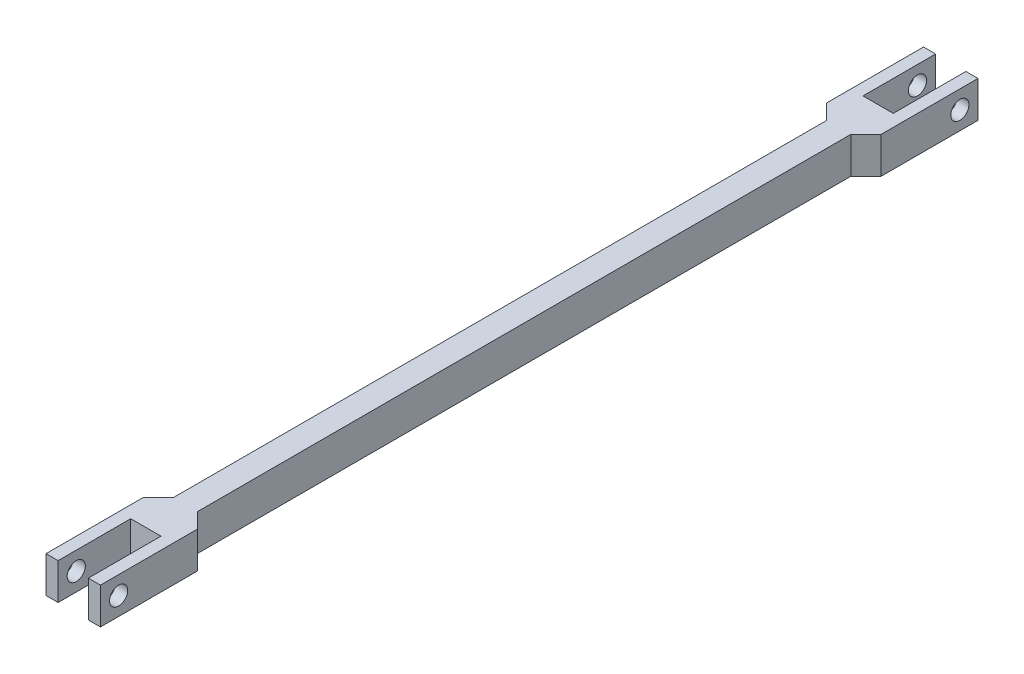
ISO-10303-21;
HEADER;
FILE_DESCRIPTION(('STEP AP214'),'2;1');
FILE_NAME('part.step','',(''),(''),'','','');
FILE_SCHEMA(('AUTOMOTIVE_DESIGN { 1 0 10303 214 1 1 1 1 }'));
ENDSEC;
DATA;
#1=APPLICATION_CONTEXT('core data for automotive mechanical design processes');
#2=APPLICATION_PROTOCOL_DEFINITION('international standard','automotive_design',2000,#1);
#3=PRODUCT_CONTEXT('',#1,'mechanical');
#4=PRODUCT('Part','Part','',(#3));
#5=PRODUCT_RELATED_PRODUCT_CATEGORY('part','',(#4));
#6=PRODUCT_DEFINITION_FORMATION('','',#4);
#7=PRODUCT_DEFINITION_CONTEXT('part definition',#1,'design');
#8=PRODUCT_DEFINITION('design','',#6,#7);
#9=PRODUCT_DEFINITION_SHAPE('','',#8);
#10=(LENGTH_UNIT() NAMED_UNIT(*) SI_UNIT(.MILLI.,.METRE.));
#11=(NAMED_UNIT(*) PLANE_ANGLE_UNIT() SI_UNIT($,.RADIAN.));
#12=(NAMED_UNIT(*) SI_UNIT($,.STERADIAN.) SOLID_ANGLE_UNIT());
#13=UNCERTAINTY_MEASURE_WITH_UNIT(LENGTH_MEASURE(1.E-05),#10,'distance_accuracy_value','');
#14=(GEOMETRIC_REPRESENTATION_CONTEXT(3) GLOBAL_UNCERTAINTY_ASSIGNED_CONTEXT((#13)) GLOBAL_UNIT_ASSIGNED_CONTEXT((#10,
#11,#12)) REPRESENTATION_CONTEXT('',''));
#15=CARTESIAN_POINT('',(0.,0.,0.));
#16=DIRECTION('',(0.,0.,1.));
#17=DIRECTION('',(1.,0.,0.));
#18=AXIS2_PLACEMENT_3D('',#15,#16,#17);
#19=CARTESIAN_POINT('',(-7.,6.,-145.));
#20=DIRECTION('',(0.,0.,1.));
#21=DIRECTION('',(1.,0.,0.));
#22=AXIS2_PLACEMENT_3D('',#19,#20,#21);
#23=PLANE('',#22);
#24=DIRECTION('',(-1.,0.,0.));
#25=VECTOR('',#24,1.);
#26=CARTESIAN_POINT('',(-7.,0.,-145.));
#27=LINE('',#26,#25);
#28=CARTESIAN_POINT('',(-7.,0.,-145.));
#29=VERTEX_POINT('',#28);
#30=CARTESIAN_POINT('',(-9.,0.,-145.));
#31=VERTEX_POINT('',#30);
#32=EDGE_CURVE('E202',#29,#31,#27,.T.);
#33=ORIENTED_EDGE('',*,*,#32,.T.);
#34=DIRECTION('',(0.,-1.,0.));
#35=VECTOR('',#34,1.);
#36=CARTESIAN_POINT('',(-9.,6.,-145.));
#37=LINE('',#36,#35);
#38=CARTESIAN_POINT('',(-9.,6.,-145.));
#39=VERTEX_POINT('',#38);
#40=EDGE_CURVE('E11',#39,#31,#37,.T.);
#41=ORIENTED_EDGE('',*,*,#40,.F.);
#42=DIRECTION('',(-1.,0.,0.));
#43=VECTOR('',#42,1.);
#44=CARTESIAN_POINT('',(-7.,6.,-145.));
#45=LINE('',#44,#43);
#46=CARTESIAN_POINT('',(-7.,6.,-145.));
#47=VERTEX_POINT('',#46);
#48=EDGE_CURVE('E241',#47,#39,#45,.T.);
#49=ORIENTED_EDGE('',*,*,#48,.F.);
#50=DIRECTION('',(0.,-1.,0.));
#51=VECTOR('',#50,1.);
#52=CARTESIAN_POINT('',(-7.,6.,-145.));
#53=LINE('',#52,#51);
#54=EDGE_CURVE('E198',#47,#29,#53,.T.);
#55=ORIENTED_EDGE('',*,*,#54,.T.);
#56=EDGE_LOOP('',(#33,#41,#49,#55));
#57=FACE_BOUND('',#56,.T.);
#58=ADVANCED_FACE('F33',(#57),#23,.F.);
#59=CARTESIAN_POINT('',(-9.,6.,-145.));
#60=DIRECTION('',(1.,0.,0.));
#61=DIRECTION('',(0.,0.,-1.));
#62=AXIS2_PLACEMENT_3D('',#59,#60,#61);
#63=PLANE('',#62);
#64=CARTESIAN_POINT('',(-9.,3.,-142.000000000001));
#65=DIRECTION('',(-1.,0.,0.));
#66=DIRECTION('',(0.,0.,1.));
#67=AXIS2_PLACEMENT_3D('',#64,#65,#66);
#68=CIRCLE('',#67,1.5);
#69=CARTESIAN_POINT('',(-9.,3.,-140.500000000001));
#70=VERTEX_POINT('',#69);
#71=EDGE_CURVE('E469',#70,#70,#68,.T.);
#72=ORIENTED_EDGE('',*,*,#71,.F.);
#73=EDGE_LOOP('',(#72));
#74=FACE_BOUND('',#73,.T.);
#75=DIRECTION('',(0.,0.,1.));
#76=VECTOR('',#75,1.);
#77=CARTESIAN_POINT('',(-9.,0.,-145.));
#78=LINE('',#77,#76);
#79=CARTESIAN_POINT('',(-9.,0.,-129.));
#80=VERTEX_POINT('',#79);
#81=EDGE_CURVE('E205',#31,#80,#78,.T.);
#82=ORIENTED_EDGE('',*,*,#81,.T.);
#83=DIRECTION('',(0.,-1.,0.));
#84=VECTOR('',#83,1.);
#85=CARTESIAN_POINT('',(-9.,6.,-129.));
#86=LINE('',#85,#84);
#87=CARTESIAN_POINT('',(-9.,6.,-129.));
#88=VERTEX_POINT('',#87);
#89=EDGE_CURVE('E42',#88,#80,#86,.T.);
#90=ORIENTED_EDGE('',*,*,#89,.F.);
#91=DIRECTION('',(0.,0.,1.));
#92=VECTOR('',#91,1.);
#93=CARTESIAN_POINT('',(-9.,6.,-145.));
#94=LINE('',#93,#92);
#95=EDGE_CURVE('E129',#39,#88,#94,.T.);
#96=ORIENTED_EDGE('',*,*,#95,.F.);
#97=ORIENTED_EDGE('',*,*,#40,.T.);
#98=EDGE_LOOP('',(#82,#90,#96,#97));
#99=FACE_BOUND('',#98,.T.);
#100=ADVANCED_FACE('F362',(#74,#99),#63,.F.);
#101=CARTESIAN_POINT('',(-9.,6.,-129.));
#102=DIRECTION('',(0.707106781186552,0.,-0.707106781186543));
#103=DIRECTION('',(-0.707106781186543,0.,-0.707106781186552));
#104=AXIS2_PLACEMENT_3D('',#101,#102,#103);
#105=PLANE('',#104);
#106=DIRECTION('',(0.707106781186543,0.,0.707106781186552));
#107=VECTOR('',#106,1.);
#108=CARTESIAN_POINT('',(-9.,0.,-129.));
#109=LINE('',#108,#107);
#110=CARTESIAN_POINT('',(-6.5,0.,-126.5));
#111=VERTEX_POINT('',#110);
#112=EDGE_CURVE('E208',#80,#111,#109,.T.);
#113=ORIENTED_EDGE('',*,*,#112,.T.);
#114=DIRECTION('',(0.,-1.,0.));
#115=VECTOR('',#114,1.);
#116=CARTESIAN_POINT('',(-6.5,6.,-126.5));
#117=LINE('',#116,#115);
#118=CARTESIAN_POINT('',(-6.5,6.,-126.5));
#119=VERTEX_POINT('',#118);
#120=EDGE_CURVE('E284',#119,#111,#117,.T.);
#121=ORIENTED_EDGE('',*,*,#120,.F.);
#122=DIRECTION('',(0.707106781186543,0.,0.707106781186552));
#123=VECTOR('',#122,1.);
#124=CARTESIAN_POINT('',(-9.,6.,-129.));
#125=LINE('',#124,#123);
#126=EDGE_CURVE('E293',#88,#119,#125,.T.);
#127=ORIENTED_EDGE('',*,*,#126,.F.);
#128=ORIENTED_EDGE('',*,*,#89,.T.);
#129=EDGE_LOOP('',(#113,#121,#127,#128));
#130=FACE_BOUND('',#129,.T.);
#131=ADVANCED_FACE('F291',(#130),#105,.F.);
#132=CARTESIAN_POINT('',(-6.5,6.,-126.5));
#133=DIRECTION('',(1.,0.,0.));
#134=DIRECTION('',(0.,0.,-1.));
#135=AXIS2_PLACEMENT_3D('',#132,#133,#134);
#136=PLANE('',#135);
#137=DIRECTION('',(0.,0.,1.));
#138=VECTOR('',#137,1.);
#139=CARTESIAN_POINT('',(-6.5,0.,-126.5));
#140=LINE('',#139,#138);
#141=CARTESIAN_POINT('',(-6.49999999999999,0.,-18.5));
#142=VERTEX_POINT('',#141);
#143=EDGE_CURVE('E210',#111,#142,#140,.T.);
#144=ORIENTED_EDGE('',*,*,#143,.T.);
#145=DIRECTION('',(0.,-1.,0.));
#146=VECTOR('',#145,1.);
#147=CARTESIAN_POINT('',(-6.49999999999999,6.,-18.5));
#148=LINE('',#147,#146);
#149=CARTESIAN_POINT('',(-6.49999999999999,6.,-18.5));
#150=VERTEX_POINT('',#149);
#151=EDGE_CURVE('E281',#150,#142,#148,.T.);
#152=ORIENTED_EDGE('',*,*,#151,.F.);
#153=DIRECTION('',(0.,0.,1.));
#154=VECTOR('',#153,1.);
#155=CARTESIAN_POINT('',(-6.5,6.,-126.5));
#156=LINE('',#155,#154);
#157=EDGE_CURVE('E311',#119,#150,#156,.T.);
#158=ORIENTED_EDGE('',*,*,#157,.F.);
#159=ORIENTED_EDGE('',*,*,#120,.T.);
#160=EDGE_LOOP('',(#144,#152,#158,#159));
#161=FACE_BOUND('',#160,.T.);
#162=ADVANCED_FACE('F302',(#161),#136,.F.);
#163=CARTESIAN_POINT('',(-6.49999999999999,6.,-18.5));
#164=DIRECTION('',(0.707106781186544,0.,0.707106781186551));
#165=DIRECTION('',(0.707106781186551,0.,-0.707106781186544));
#166=AXIS2_PLACEMENT_3D('',#163,#164,#165);
#167=PLANE('',#166);
#168=DIRECTION('',(-0.707106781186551,0.,0.707106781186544));
#169=VECTOR('',#168,1.);
#170=CARTESIAN_POINT('',(-6.49999999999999,0.,-18.5));
#171=LINE('',#170,#169);
#172=CARTESIAN_POINT('',(-9.00000000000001,0.,-16.));
#173=VERTEX_POINT('',#172);
#174=EDGE_CURVE('E212',#142,#173,#171,.T.);
#175=ORIENTED_EDGE('',*,*,#174,.T.);
#176=DIRECTION('',(0.,-1.,0.));
#177=VECTOR('',#176,1.);
#178=CARTESIAN_POINT('',(-9.00000000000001,6.,-16.));
#179=LINE('',#178,#177);
#180=CARTESIAN_POINT('',(-9.00000000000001,6.,-16.));
#181=VERTEX_POINT('',#180);
#182=EDGE_CURVE('E278',#181,#173,#179,.T.);
#183=ORIENTED_EDGE('',*,*,#182,.F.);
#184=DIRECTION('',(-0.707106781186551,0.,0.707106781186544));
#185=VECTOR('',#184,1.);
#186=CARTESIAN_POINT('',(-6.49999999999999,6.,-18.5));
#187=LINE('',#186,#185);
#188=EDGE_CURVE('E308',#150,#181,#187,.T.);
#189=ORIENTED_EDGE('',*,*,#188,.F.);
#190=ORIENTED_EDGE('',*,*,#151,.T.);
#191=EDGE_LOOP('',(#175,#183,#189,#190));
#192=FACE_BOUND('',#191,.T.);
#193=ADVANCED_FACE('F306',(#192),#167,.F.);
#194=CARTESIAN_POINT('',(-9.00000000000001,6.,-16.));
#195=DIRECTION('',(1.,0.,0.));
#196=DIRECTION('',(0.,0.,-1.));
#197=AXIS2_PLACEMENT_3D('',#194,#195,#196);
#198=PLANE('',#197);
#199=CARTESIAN_POINT('',(-8.99999999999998,3.,-3.));
#200=DIRECTION('',(-1.,0.,0.));
#201=DIRECTION('',(0.,0.,1.));
#202=AXIS2_PLACEMENT_3D('',#199,#200,#201);
#203=CIRCLE('',#202,1.5);
#204=CARTESIAN_POINT('',(-8.99999999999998,3.,-1.5));
#205=VERTEX_POINT('',#204);
#206=EDGE_CURVE('E436',#205,#205,#203,.T.);
#207=ORIENTED_EDGE('',*,*,#206,.F.);
#208=EDGE_LOOP('',(#207));
#209=FACE_BOUND('',#208,.T.);
#210=DIRECTION('',(0.,0.,1.));
#211=VECTOR('',#210,1.);
#212=CARTESIAN_POINT('',(-9.00000000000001,0.,-16.));
#213=LINE('',#212,#211);
#214=CARTESIAN_POINT('',(-9.,0.,0.));
#215=VERTEX_POINT('',#214);
#216=EDGE_CURVE('E214',#173,#215,#213,.T.);
#217=ORIENTED_EDGE('',*,*,#216,.T.);
#218=DIRECTION('',(0.,-1.,0.));
#219=VECTOR('',#218,1.);
#220=CARTESIAN_POINT('',(-9.,6.,0.));
#221=LINE('',#220,#219);
#222=CARTESIAN_POINT('',(-9.,6.,0.));
#223=VERTEX_POINT('',#222);
#224=EDGE_CURVE('E275',#223,#215,#221,.T.);
#225=ORIENTED_EDGE('',*,*,#224,.F.);
#226=DIRECTION('',(0.,0.,1.));
#227=VECTOR('',#226,1.);
#228=CARTESIAN_POINT('',(-9.00000000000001,6.,-16.));
#229=LINE('',#228,#227);
#230=EDGE_CURVE('E310',#181,#223,#229,.T.);
#231=ORIENTED_EDGE('',*,*,#230,.F.);
#232=ORIENTED_EDGE('',*,*,#182,.T.);
#233=EDGE_LOOP('',(#217,#225,#231,#232));
#234=FACE_BOUND('',#233,.T.);
#235=ADVANCED_FACE('F377',(#209,#234),#198,.F.);
#236=CARTESIAN_POINT('',(-9.,6.,0.));
#237=DIRECTION('',(0.,0.,-1.));
#238=DIRECTION('',(-1.,0.,0.));
#239=AXIS2_PLACEMENT_3D('',#236,#237,#238);
#240=PLANE('',#239);
#241=DIRECTION('',(1.,0.,0.));
#242=VECTOR('',#241,1.);
#243=CARTESIAN_POINT('',(-9.,0.,0.));
#244=LINE('',#243,#242);
#245=CARTESIAN_POINT('',(-7.,0.,0.));
#246=VERTEX_POINT('',#245);
#247=EDGE_CURVE('E216',#215,#246,#244,.T.);
#248=ORIENTED_EDGE('',*,*,#247,.T.);
#249=DIRECTION('',(0.,-1.,0.));
#250=VECTOR('',#249,1.);
#251=CARTESIAN_POINT('',(-7.,6.,0.));
#252=LINE('',#251,#250);
#253=CARTESIAN_POINT('',(-7.,6.,0.));
#254=VERTEX_POINT('',#253);
#255=EDGE_CURVE('E272',#254,#246,#252,.T.);
#256=ORIENTED_EDGE('',*,*,#255,.F.);
#257=DIRECTION('',(1.,0.,0.));
#258=VECTOR('',#257,1.);
#259=CARTESIAN_POINT('',(-9.,6.,0.));
#260=LINE('',#259,#258);
#261=EDGE_CURVE('E313',#223,#254,#260,.T.);
#262=ORIENTED_EDGE('',*,*,#261,.F.);
#263=ORIENTED_EDGE('',*,*,#224,.T.);
#264=EDGE_LOOP('',(#248,#256,#262,#263));
#265=FACE_BOUND('',#264,.T.);
#266=ADVANCED_FACE('F380',(#265),#240,.F.);
#267=CARTESIAN_POINT('',(-7.,6.,0.));
#268=DIRECTION('',(-1.,0.,0.));
#269=DIRECTION('',(0.,0.,1.));
#270=AXIS2_PLACEMENT_3D('',#267,#268,#269);
#271=PLANE('',#270);
#272=CARTESIAN_POINT('',(-7.,3.,-3.));
#273=DIRECTION('',(-1.,0.,0.));
#274=DIRECTION('',(0.,0.,1.));
#275=AXIS2_PLACEMENT_3D('',#272,#273,#274);
#276=CIRCLE('',#275,1.5);
#277=CARTESIAN_POINT('',(-7.,3.,-1.5));
#278=VERTEX_POINT('',#277);
#279=EDGE_CURVE('E206',#278,#278,#276,.T.);
#280=ORIENTED_EDGE('',*,*,#279,.T.);
#281=EDGE_LOOP('',(#280));
#282=FACE_BOUND('',#281,.T.);
#283=DIRECTION('',(0.,0.,-1.));
#284=VECTOR('',#283,1.);
#285=CARTESIAN_POINT('',(-7.,0.,0.));
#286=LINE('',#285,#284);
#287=CARTESIAN_POINT('',(-7.,0.,-12.));
#288=VERTEX_POINT('',#287);
#289=EDGE_CURVE('E218',#246,#288,#286,.T.);
#290=ORIENTED_EDGE('',*,*,#289,.T.);
#291=DIRECTION('',(0.,-1.,0.));
#292=VECTOR('',#291,1.);
#293=CARTESIAN_POINT('',(-7.,6.,-12.));
#294=LINE('',#293,#292);
#295=CARTESIAN_POINT('',(-7.,6.,-12.));
#296=VERTEX_POINT('',#295);
#297=EDGE_CURVE('E269',#296,#288,#294,.T.);
#298=ORIENTED_EDGE('',*,*,#297,.F.);
#299=DIRECTION('',(0.,0.,-1.));
#300=VECTOR('',#299,1.);
#301=CARTESIAN_POINT('',(-7.,6.,0.));
#302=LINE('',#301,#300);
#303=EDGE_CURVE('E319',#254,#296,#302,.T.);
#304=ORIENTED_EDGE('',*,*,#303,.F.);
#305=ORIENTED_EDGE('',*,*,#255,.T.);
#306=EDGE_LOOP('',(#290,#298,#304,#305));
#307=FACE_BOUND('',#306,.T.);
#308=ADVANCED_FACE('F384',(#282,#307),#271,.F.);
#309=CARTESIAN_POINT('',(-7.,6.,-12.));
#310=DIRECTION('',(0.,0.,-1.));
#311=DIRECTION('',(-1.,0.,0.));
#312=AXIS2_PLACEMENT_3D('',#309,#310,#311);
#313=PLANE('',#312);
#314=DIRECTION('',(1.,0.,0.));
#315=VECTOR('',#314,1.);
#316=CARTESIAN_POINT('',(-7.,0.,-12.));
#317=LINE('',#316,#315);
#318=CARTESIAN_POINT('',(-2.,0.,-12.));
#319=VERTEX_POINT('',#318);
#320=EDGE_CURVE('E220',#288,#319,#317,.T.);
#321=ORIENTED_EDGE('',*,*,#320,.T.);
#322=DIRECTION('',(0.,-1.,0.));
#323=VECTOR('',#322,1.);
#324=CARTESIAN_POINT('',(-2.,6.,-12.));
#325=LINE('',#324,#323);
#326=CARTESIAN_POINT('',(-2.,6.,-12.));
#327=VERTEX_POINT('',#326);
#328=EDGE_CURVE('E266',#327,#319,#325,.T.);
#329=ORIENTED_EDGE('',*,*,#328,.F.);
#330=DIRECTION('',(1.,0.,0.));
#331=VECTOR('',#330,1.);
#332=CARTESIAN_POINT('',(-7.,6.,-12.));
#333=LINE('',#332,#331);
#334=EDGE_CURVE('E321',#296,#327,#333,.T.);
#335=ORIENTED_EDGE('',*,*,#334,.F.);
#336=ORIENTED_EDGE('',*,*,#297,.T.);
#337=EDGE_LOOP('',(#321,#329,#335,#336));
#338=FACE_BOUND('',#337,.T.);
#339=ADVANCED_FACE('F388',(#338),#313,.F.);
#340=CARTESIAN_POINT('',(-2.,6.,-12.));
#341=DIRECTION('',(1.,0.,0.));
#342=DIRECTION('',(0.,0.,-1.));
#343=AXIS2_PLACEMENT_3D('',#340,#341,#342);
#344=PLANE('',#343);
#345=CARTESIAN_POINT('',(-2.,3.,-3.));
#346=DIRECTION('',(1.,0.,0.));
#347=DIRECTION('',(0.,0.,-1.));
#348=AXIS2_PLACEMENT_3D('',#345,#346,#347);
#349=CIRCLE('',#348,1.5);
#350=CARTESIAN_POINT('',(-2.,3.,-4.5));
#351=VERTEX_POINT('',#350);
#352=EDGE_CURVE('E430',#351,#351,#349,.T.);
#353=ORIENTED_EDGE('',*,*,#352,.T.);
#354=EDGE_LOOP('',(#353));
#355=FACE_BOUND('',#354,.T.);
#356=DIRECTION('',(0.,0.,1.));
#357=VECTOR('',#356,1.);
#358=CARTESIAN_POINT('',(-2.,0.,-12.));
#359=LINE('',#358,#357);
#360=CARTESIAN_POINT('',(-2.,0.,0.));
#361=VERTEX_POINT('',#360);
#362=EDGE_CURVE('E222',#319,#361,#359,.T.);
#363=ORIENTED_EDGE('',*,*,#362,.T.);
#364=DIRECTION('',(0.,-1.,0.));
#365=VECTOR('',#364,1.);
#366=CARTESIAN_POINT('',(-2.,6.,0.));
#367=LINE('',#366,#365);
#368=CARTESIAN_POINT('',(-2.,6.,0.));
#369=VERTEX_POINT('',#368);
#370=EDGE_CURVE('E263',#369,#361,#367,.T.);
#371=ORIENTED_EDGE('',*,*,#370,.F.);
#372=DIRECTION('',(0.,0.,1.));
#373=VECTOR('',#372,1.);
#374=CARTESIAN_POINT('',(-2.,6.,-12.));
#375=LINE('',#374,#373);
#376=EDGE_CURVE('E323',#327,#369,#375,.T.);
#377=ORIENTED_EDGE('',*,*,#376,.F.);
#378=ORIENTED_EDGE('',*,*,#328,.T.);
#379=EDGE_LOOP('',(#363,#371,#377,#378));
#380=FACE_BOUND('',#379,.T.);
#381=ADVANCED_FACE('F392',(#355,#380),#344,.F.);
#382=CARTESIAN_POINT('',(-2.,6.,0.));
#383=DIRECTION('',(0.,0.,-1.));
#384=DIRECTION('',(-1.,0.,0.));
#385=AXIS2_PLACEMENT_3D('',#382,#383,#384);
#386=PLANE('',#385);
#387=DIRECTION('',(1.,0.,0.));
#388=VECTOR('',#387,1.);
#389=CARTESIAN_POINT('',(-2.,0.,0.));
#390=LINE('',#389,#388);
#391=CARTESIAN_POINT('',(0.,0.,0.));
#392=VERTEX_POINT('',#391);
#393=EDGE_CURVE('E224',#361,#392,#390,.T.);
#394=ORIENTED_EDGE('',*,*,#393,.T.);
#395=DIRECTION('',(0.,-1.,0.));
#396=VECTOR('',#395,1.);
#397=CARTESIAN_POINT('',(0.,6.,0.));
#398=LINE('',#397,#396);
#399=CARTESIAN_POINT('',(0.,6.,0.));
#400=VERTEX_POINT('',#399);
#401=EDGE_CURVE('E260',#400,#392,#398,.T.);
#402=ORIENTED_EDGE('',*,*,#401,.F.);
#403=DIRECTION('',(1.,0.,0.));
#404=VECTOR('',#403,1.);
#405=CARTESIAN_POINT('',(-2.,6.,0.));
#406=LINE('',#405,#404);
#407=EDGE_CURVE('E325',#369,#400,#406,.T.);
#408=ORIENTED_EDGE('',*,*,#407,.F.);
#409=ORIENTED_EDGE('',*,*,#370,.T.);
#410=EDGE_LOOP('',(#394,#402,#408,#409));
#411=FACE_BOUND('',#410,.T.);
#412=ADVANCED_FACE('F396',(#411),#386,.F.);
#413=CARTESIAN_POINT('',(0.,6.,0.));
#414=DIRECTION('',(-1.,0.,0.));
#415=DIRECTION('',(0.,0.,1.));
#416=AXIS2_PLACEMENT_3D('',#413,#414,#415);
#417=PLANE('',#416);
#418=CARTESIAN_POINT('',(0.,3.,-3.));
#419=DIRECTION('',(-1.,0.,0.));
#420=DIRECTION('',(0.,0.,1.));
#421=AXIS2_PLACEMENT_3D('',#418,#419,#420);
#422=CIRCLE('',#421,1.5);
#423=CARTESIAN_POINT('',(0.,3.,-1.5));
#424=VERTEX_POINT('',#423);
#425=EDGE_CURVE('E471',#424,#424,#422,.T.);
#426=ORIENTED_EDGE('',*,*,#425,.T.);
#427=EDGE_LOOP('',(#426));
#428=FACE_BOUND('',#427,.T.);
#429=DIRECTION('',(0.,0.,-1.));
#430=VECTOR('',#429,1.);
#431=CARTESIAN_POINT('',(0.,0.,0.));
#432=LINE('',#431,#430);
#433=CARTESIAN_POINT('',(0.,0.,-16.));
#434=VERTEX_POINT('',#433);
#435=EDGE_CURVE('E226',#392,#434,#432,.T.);
#436=ORIENTED_EDGE('',*,*,#435,.T.);
#437=DIRECTION('',(0.,-1.,0.));
#438=VECTOR('',#437,1.);
#439=CARTESIAN_POINT('',(0.,6.,-16.));
#440=LINE('',#439,#438);
#441=CARTESIAN_POINT('',(0.,6.,-16.));
#442=VERTEX_POINT('',#441);
#443=EDGE_CURVE('E257',#442,#434,#440,.T.);
#444=ORIENTED_EDGE('',*,*,#443,.F.);
#445=DIRECTION('',(0.,0.,-1.));
#446=VECTOR('',#445,1.);
#447=CARTESIAN_POINT('',(0.,6.,0.));
#448=LINE('',#447,#446);
#449=EDGE_CURVE('E327',#400,#442,#448,.T.);
#450=ORIENTED_EDGE('',*,*,#449,.F.);
#451=ORIENTED_EDGE('',*,*,#401,.T.);
#452=EDGE_LOOP('',(#436,#444,#450,#451));
#453=FACE_BOUND('',#452,.T.);
#454=ADVANCED_FACE('F400',(#428,#453),#417,.F.);
#455=CARTESIAN_POINT('',(0.,6.,-16.));
#456=DIRECTION('',(-0.707106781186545,0.,0.70710678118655));
#457=DIRECTION('',(0.70710678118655,0.,0.707106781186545));
#458=AXIS2_PLACEMENT_3D('',#455,#456,#457);
#459=PLANE('',#458);
#460=DIRECTION('',(-0.70710678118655,0.,-0.707106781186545));
#461=VECTOR('',#460,1.);
#462=CARTESIAN_POINT('',(0.,0.,-16.));
#463=LINE('',#462,#461);
#464=CARTESIAN_POINT('',(-2.5,0.,-18.5));
#465=VERTEX_POINT('',#464);
#466=EDGE_CURVE('E228',#434,#465,#463,.T.);
#467=ORIENTED_EDGE('',*,*,#466,.T.);
#468=DIRECTION('',(0.,-1.,0.));
#469=VECTOR('',#468,1.);
#470=CARTESIAN_POINT('',(-2.5,6.,-18.5));
#471=LINE('',#470,#469);
#472=CARTESIAN_POINT('',(-2.5,6.,-18.5));
#473=VERTEX_POINT('',#472);
#474=EDGE_CURVE('E254',#473,#465,#471,.T.);
#475=ORIENTED_EDGE('',*,*,#474,.F.);
#476=DIRECTION('',(-0.70710678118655,0.,-0.707106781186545));
#477=VECTOR('',#476,1.);
#478=CARTESIAN_POINT('',(0.,6.,-16.));
#479=LINE('',#478,#477);
#480=EDGE_CURVE('E329',#442,#473,#479,.T.);
#481=ORIENTED_EDGE('',*,*,#480,.F.);
#482=ORIENTED_EDGE('',*,*,#443,.T.);
#483=EDGE_LOOP('',(#467,#475,#481,#482));
#484=FACE_BOUND('',#483,.T.);
#485=ADVANCED_FACE('F404',(#484),#459,.F.);
#486=CARTESIAN_POINT('',(-2.5,6.,-18.5));
#487=DIRECTION('',(-1.,0.,0.));
#488=DIRECTION('',(0.,0.,1.));
#489=AXIS2_PLACEMENT_3D('',#486,#487,#488);
#490=PLANE('',#489);
#491=DIRECTION('',(0.,0.,-1.));
#492=VECTOR('',#491,1.);
#493=CARTESIAN_POINT('',(-2.5,0.,-18.5));
#494=LINE('',#493,#492);
#495=CARTESIAN_POINT('',(-2.5,0.,-126.5));
#496=VERTEX_POINT('',#495);
#497=EDGE_CURVE('E230',#465,#496,#494,.T.);
#498=ORIENTED_EDGE('',*,*,#497,.T.);
#499=DIRECTION('',(0.,-1.,0.));
#500=VECTOR('',#499,1.);
#501=CARTESIAN_POINT('',(-2.5,6.,-126.5));
#502=LINE('',#501,#500);
#503=CARTESIAN_POINT('',(-2.5,6.,-126.5));
#504=VERTEX_POINT('',#503);
#505=EDGE_CURVE('E251',#504,#496,#502,.T.);
#506=ORIENTED_EDGE('',*,*,#505,.F.);
#507=DIRECTION('',(0.,0.,-1.));
#508=VECTOR('',#507,1.);
#509=CARTESIAN_POINT('',(-2.5,6.,-18.5));
#510=LINE('',#509,#508);
#511=EDGE_CURVE('E331',#473,#504,#510,.T.);
#512=ORIENTED_EDGE('',*,*,#511,.F.);
#513=ORIENTED_EDGE('',*,*,#474,.T.);
#514=EDGE_LOOP('',(#498,#506,#512,#513));
#515=FACE_BOUND('',#514,.T.);
#516=ADVANCED_FACE('F408',(#515),#490,.F.);
#517=CARTESIAN_POINT('',(-2.5,6.,-126.5));
#518=DIRECTION('',(-0.707106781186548,0.,-0.707106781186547));
#519=DIRECTION('',(-0.707106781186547,0.,0.707106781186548));
#520=AXIS2_PLACEMENT_3D('',#517,#518,#519);
#521=PLANE('',#520);
#522=DIRECTION('',(0.707106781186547,0.,-0.707106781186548));
#523=VECTOR('',#522,1.);
#524=CARTESIAN_POINT('',(-2.5,0.,-126.5));
#525=LINE('',#524,#523);
#526=CARTESIAN_POINT('',(0.,0.,-129.));
#527=VERTEX_POINT('',#526);
#528=EDGE_CURVE('E232',#496,#527,#525,.T.);
#529=ORIENTED_EDGE('',*,*,#528,.T.);
#530=DIRECTION('',(0.,-1.,0.));
#531=VECTOR('',#530,1.);
#532=CARTESIAN_POINT('',(0.,6.,-129.));
#533=LINE('',#532,#531);
#534=CARTESIAN_POINT('',(0.,6.,-129.));
#535=VERTEX_POINT('',#534);
#536=EDGE_CURVE('E248',#535,#527,#533,.T.);
#537=ORIENTED_EDGE('',*,*,#536,.F.);
#538=DIRECTION('',(0.707106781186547,0.,-0.707106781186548));
#539=VECTOR('',#538,1.);
#540=CARTESIAN_POINT('',(-2.5,6.,-126.5));
#541=LINE('',#540,#539);
#542=EDGE_CURVE('E333',#504,#535,#541,.T.);
#543=ORIENTED_EDGE('',*,*,#542,.F.);
#544=ORIENTED_EDGE('',*,*,#505,.T.);
#545=EDGE_LOOP('',(#529,#537,#543,#544));
#546=FACE_BOUND('',#545,.T.);
#547=ADVANCED_FACE('F412',(#546),#521,.F.);
#548=CARTESIAN_POINT('',(0.,6.,-129.));
#549=DIRECTION('',(-1.,0.,0.));
#550=DIRECTION('',(0.,0.,1.));
#551=AXIS2_PLACEMENT_3D('',#548,#549,#550);
#552=PLANE('',#551);
#553=CARTESIAN_POINT('',(0.,3.,-142.000000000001));
#554=DIRECTION('',(-1.,0.,0.));
#555=DIRECTION('',(0.,0.,1.));
#556=AXIS2_PLACEMENT_3D('',#553,#554,#555);
#557=CIRCLE('',#556,1.5);
#558=CARTESIAN_POINT('',(0.,3.,-140.500000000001));
#559=VERTEX_POINT('',#558);
#560=EDGE_CURVE('E434',#559,#559,#557,.T.);
#561=ORIENTED_EDGE('',*,*,#560,.T.);
#562=EDGE_LOOP('',(#561));
#563=FACE_BOUND('',#562,.T.);
#564=DIRECTION('',(0.,0.,-1.));
#565=VECTOR('',#564,1.);
#566=CARTESIAN_POINT('',(0.,0.,-129.));
#567=LINE('',#566,#565);
#568=CARTESIAN_POINT('',(0.,0.,-145.));
#569=VERTEX_POINT('',#568);
#570=EDGE_CURVE('E234',#527,#569,#567,.T.);
#571=ORIENTED_EDGE('',*,*,#570,.T.);
#572=DIRECTION('',(0.,-1.,0.));
#573=VECTOR('',#572,1.);
#574=CARTESIAN_POINT('',(0.,6.,-145.));
#575=LINE('',#574,#573);
#576=CARTESIAN_POINT('',(0.,6.,-145.));
#577=VERTEX_POINT('',#576);
#578=EDGE_CURVE('E245',#577,#569,#575,.T.);
#579=ORIENTED_EDGE('',*,*,#578,.F.);
#580=DIRECTION('',(0.,0.,-1.));
#581=VECTOR('',#580,1.);
#582=CARTESIAN_POINT('',(0.,6.,-129.));
#583=LINE('',#582,#581);
#584=EDGE_CURVE('E335',#535,#577,#583,.T.);
#585=ORIENTED_EDGE('',*,*,#584,.F.);
#586=ORIENTED_EDGE('',*,*,#536,.T.);
#587=EDGE_LOOP('',(#571,#579,#585,#586));
#588=FACE_BOUND('',#587,.T.);
#589=ADVANCED_FACE('F341',(#563,#588),#552,.F.);
#590=CARTESIAN_POINT('',(0.,6.,-145.));
#591=DIRECTION('',(0.,0.,1.));
#592=DIRECTION('',(1.,0.,0.));
#593=AXIS2_PLACEMENT_3D('',#590,#591,#592);
#594=PLANE('',#593);
#595=DIRECTION('',(-1.,0.,0.));
#596=VECTOR('',#595,1.);
#597=CARTESIAN_POINT('',(0.,0.,-145.));
#598=LINE('',#597,#596);
#599=CARTESIAN_POINT('',(-2.,0.,-145.));
#600=VERTEX_POINT('',#599);
#601=EDGE_CURVE('E236',#569,#600,#598,.T.);
#602=ORIENTED_EDGE('',*,*,#601,.T.);
#603=DIRECTION('',(0.,-1.,0.));
#604=VECTOR('',#603,1.);
#605=CARTESIAN_POINT('',(-2.,6.,-145.));
#606=LINE('',#605,#604);
#607=CARTESIAN_POINT('',(-2.,6.,-145.));
#608=VERTEX_POINT('',#607);
#609=EDGE_CURVE('E193',#608,#600,#606,.T.);
#610=ORIENTED_EDGE('',*,*,#609,.F.);
#611=DIRECTION('',(-1.,0.,0.));
#612=VECTOR('',#611,1.);
#613=CARTESIAN_POINT('',(0.,6.,-145.));
#614=LINE('',#613,#612);
#615=EDGE_CURVE('E184',#577,#608,#614,.T.);
#616=ORIENTED_EDGE('',*,*,#615,.F.);
#617=ORIENTED_EDGE('',*,*,#578,.T.);
#618=EDGE_LOOP('',(#602,#610,#616,#617));
#619=FACE_BOUND('',#618,.T.);
#620=ADVANCED_FACE('F345',(#619),#594,.F.);
#621=CARTESIAN_POINT('',(-2.,6.,-145.));
#622=DIRECTION('',(1.,0.,0.));
#623=DIRECTION('',(0.,0.,-1.));
#624=AXIS2_PLACEMENT_3D('',#621,#622,#623);
#625=PLANE('',#624);
#626=CARTESIAN_POINT('',(-2.,3.,-142.000000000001));
#627=DIRECTION('',(1.,0.,0.));
#628=DIRECTION('',(0.,0.,-1.));
#629=AXIS2_PLACEMENT_3D('',#626,#627,#628);
#630=CIRCLE('',#629,1.5);
#631=CARTESIAN_POINT('',(-2.,3.,-143.500000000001));
#632=VERTEX_POINT('',#631);
#633=EDGE_CURVE('E428',#632,#632,#630,.T.);
#634=ORIENTED_EDGE('',*,*,#633,.T.);
#635=EDGE_LOOP('',(#634));
#636=FACE_BOUND('',#635,.T.);
#637=DIRECTION('',(0.,0.,1.));
#638=VECTOR('',#637,1.);
#639=CARTESIAN_POINT('',(-2.,0.,-145.));
#640=LINE('',#639,#638);
#641=CARTESIAN_POINT('',(-2.,0.,-133.));
#642=VERTEX_POINT('',#641);
#643=EDGE_CURVE('E192',#600,#642,#640,.T.);
#644=ORIENTED_EDGE('',*,*,#643,.T.);
#645=DIRECTION('',(0.,-1.,0.));
#646=VECTOR('',#645,1.);
#647=CARTESIAN_POINT('',(-2.,6.,-133.));
#648=LINE('',#647,#646);
#649=CARTESIAN_POINT('',(-2.,6.,-133.));
#650=VERTEX_POINT('',#649);
#651=EDGE_CURVE('E189',#650,#642,#648,.T.);
#652=ORIENTED_EDGE('',*,*,#651,.F.);
#653=DIRECTION('',(0.,0.,1.));
#654=VECTOR('',#653,1.);
#655=CARTESIAN_POINT('',(-2.,6.,-145.));
#656=LINE('',#655,#654);
#657=EDGE_CURVE('E178',#608,#650,#656,.T.);
#658=ORIENTED_EDGE('',*,*,#657,.F.);
#659=ORIENTED_EDGE('',*,*,#609,.T.);
#660=EDGE_LOOP('',(#644,#652,#658,#659));
#661=FACE_BOUND('',#660,.T.);
#662=ADVANCED_FACE('F190',(#636,#661),#625,.F.);
#663=CARTESIAN_POINT('',(-2.,6.,-133.));
#664=DIRECTION('',(0.,0.,1.));
#665=DIRECTION('',(1.,0.,0.));
#666=AXIS2_PLACEMENT_3D('',#663,#664,#665);
#667=PLANE('',#666);
#668=DIRECTION('',(-1.,0.,0.));
#669=VECTOR('',#668,1.);
#670=CARTESIAN_POINT('',(-2.,0.,-133.));
#671=LINE('',#670,#669);
#672=CARTESIAN_POINT('',(-7.,0.,-133.));
#673=VERTEX_POINT('',#672);
#674=EDGE_CURVE('E115',#642,#673,#671,.T.);
#675=ORIENTED_EDGE('',*,*,#674,.T.);
#676=DIRECTION('',(0.,-1.,0.));
#677=VECTOR('',#676,1.);
#678=CARTESIAN_POINT('',(-7.,6.,-133.));
#679=LINE('',#678,#677);
#680=CARTESIAN_POINT('',(-7.,6.,-133.));
#681=VERTEX_POINT('',#680);
#682=EDGE_CURVE('E194',#681,#673,#679,.T.);
#683=ORIENTED_EDGE('',*,*,#682,.F.);
#684=DIRECTION('',(-1.,0.,0.));
#685=VECTOR('',#684,1.);
#686=CARTESIAN_POINT('',(-2.,6.,-133.));
#687=LINE('',#686,#685);
#688=EDGE_CURVE('E182',#650,#681,#687,.T.);
#689=ORIENTED_EDGE('',*,*,#688,.F.);
#690=ORIENTED_EDGE('',*,*,#651,.T.);
#691=EDGE_LOOP('',(#675,#683,#689,#690));
#692=FACE_BOUND('',#691,.T.);
#693=ADVANCED_FACE('F196',(#692),#667,.F.);
#694=CARTESIAN_POINT('',(-7.,6.,-133.));
#695=DIRECTION('',(-1.,0.,0.));
#696=DIRECTION('',(0.,0.,1.));
#697=AXIS2_PLACEMENT_3D('',#694,#695,#696);
#698=PLANE('',#697);
#699=CARTESIAN_POINT('',(-7.,3.,-142.000000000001));
#700=DIRECTION('',(-1.,0.,0.));
#701=DIRECTION('',(0.,0.,1.));
#702=AXIS2_PLACEMENT_3D('',#699,#700,#701);
#703=CIRCLE('',#702,1.5);
#704=CARTESIAN_POINT('',(-7.,3.,-140.500000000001));
#705=VERTEX_POINT('',#704);
#706=EDGE_CURVE('E36',#705,#705,#703,.T.);
#707=ORIENTED_EDGE('',*,*,#706,.T.);
#708=EDGE_LOOP('',(#707));
#709=FACE_BOUND('',#708,.T.);
#710=DIRECTION('',(0.,0.,-1.));
#711=VECTOR('',#710,1.);
#712=CARTESIAN_POINT('',(-7.,0.,-133.));
#713=LINE('',#712,#711);
#714=EDGE_CURVE('E121',#673,#29,#713,.T.);
#715=ORIENTED_EDGE('',*,*,#714,.T.);
#716=ORIENTED_EDGE('',*,*,#54,.F.);
#717=DIRECTION('',(0.,0.,-1.));
#718=VECTOR('',#717,1.);
#719=CARTESIAN_POINT('',(-7.,6.,-133.));
#720=LINE('',#719,#718);
#721=EDGE_CURVE('E50',#681,#47,#720,.T.);
#722=ORIENTED_EDGE('',*,*,#721,.F.);
#723=ORIENTED_EDGE('',*,*,#682,.T.);
#724=EDGE_LOOP('',(#715,#716,#722,#723));
#725=FACE_BOUND('',#724,.T.);
#726=ADVANCED_FACE('F349',(#709,#725),#698,.F.);
#727=CARTESIAN_POINT('',(0.,6.,0.));
#728=DIRECTION('',(0.,1.,0.));
#729=DIRECTION('',(0.,0.,1.));
#730=AXIS2_PLACEMENT_3D('',#727,#728,#729);
#731=PLANE('',#730);
#732=ORIENTED_EDGE('',*,*,#48,.T.);
#733=ORIENTED_EDGE('',*,*,#95,.T.);
#734=ORIENTED_EDGE('',*,*,#126,.T.);
#735=ORIENTED_EDGE('',*,*,#157,.T.);
#736=ORIENTED_EDGE('',*,*,#188,.T.);
#737=ORIENTED_EDGE('',*,*,#230,.T.);
#738=ORIENTED_EDGE('',*,*,#261,.T.);
#739=ORIENTED_EDGE('',*,*,#303,.T.);
#740=ORIENTED_EDGE('',*,*,#334,.T.);
#741=ORIENTED_EDGE('',*,*,#376,.T.);
#742=ORIENTED_EDGE('',*,*,#407,.T.);
#743=ORIENTED_EDGE('',*,*,#449,.T.);
#744=ORIENTED_EDGE('',*,*,#480,.T.);
#745=ORIENTED_EDGE('',*,*,#511,.T.);
#746=ORIENTED_EDGE('',*,*,#542,.T.);
#747=ORIENTED_EDGE('',*,*,#584,.T.);
#748=ORIENTED_EDGE('',*,*,#615,.T.);
#749=ORIENTED_EDGE('',*,*,#657,.T.);
#750=ORIENTED_EDGE('',*,*,#688,.T.);
#751=ORIENTED_EDGE('',*,*,#721,.T.);
#752=EDGE_LOOP('',(#732,#733,#734,#735,#736,#737,#738,#739,#740,#741,#742,#743,#744,#745,#746,
#747,#748,#749,#750,#751));
#753=FACE_BOUND('',#752,.T.);
#754=ADVANCED_FACE('F180',(#753),#731,.T.);
#755=CARTESIAN_POINT('',(0.,0.,0.));
#756=DIRECTION('',(0.,1.,0.));
#757=DIRECTION('',(0.,0.,1.));
#758=AXIS2_PLACEMENT_3D('',#755,#756,#757);
#759=PLANE('',#758);
#760=ORIENTED_EDGE('',*,*,#32,.F.);
#761=ORIENTED_EDGE('',*,*,#714,.F.);
#762=ORIENTED_EDGE('',*,*,#674,.F.);
#763=ORIENTED_EDGE('',*,*,#643,.F.);
#764=ORIENTED_EDGE('',*,*,#601,.F.);
#765=ORIENTED_EDGE('',*,*,#570,.F.);
#766=ORIENTED_EDGE('',*,*,#528,.F.);
#767=ORIENTED_EDGE('',*,*,#497,.F.);
#768=ORIENTED_EDGE('',*,*,#466,.F.);
#769=ORIENTED_EDGE('',*,*,#435,.F.);
#770=ORIENTED_EDGE('',*,*,#393,.F.);
#771=ORIENTED_EDGE('',*,*,#362,.F.);
#772=ORIENTED_EDGE('',*,*,#320,.F.);
#773=ORIENTED_EDGE('',*,*,#289,.F.);
#774=ORIENTED_EDGE('',*,*,#247,.F.);
#775=ORIENTED_EDGE('',*,*,#216,.F.);
#776=ORIENTED_EDGE('',*,*,#174,.F.);
#777=ORIENTED_EDGE('',*,*,#143,.F.);
#778=ORIENTED_EDGE('',*,*,#112,.F.);
#779=ORIENTED_EDGE('',*,*,#81,.F.);
#780=EDGE_LOOP('',(#760,#761,#762,#763,#764,#765,#766,#767,#768,#769,#770,#771,#772,#773,#774,
#775,#776,#777,#778,#779));
#781=FACE_BOUND('',#780,.T.);
#782=ADVANCED_FACE('F297',(#781),#759,.F.);
#783=CARTESIAN_POINT('',(0.,3.,-142.000000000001));
#784=DIRECTION('',(-1.,0.,0.));
#785=DIRECTION('',(0.,0.,1.));
#786=AXIS2_PLACEMENT_3D('',#783,#784,#785);
#787=CYLINDRICAL_SURFACE('',#786,1.5);
#788=ORIENTED_EDGE('',*,*,#71,.T.);
#789=EDGE_LOOP('',(#788));
#790=FACE_BOUND('',#789,.T.);
#791=ORIENTED_EDGE('',*,*,#706,.F.);
#792=EDGE_LOOP('',(#791));
#793=FACE_BOUND('',#792,.T.);
#794=ADVANCED_FACE('F458',(#790,#793),#787,.F.);
#795=ORIENTED_EDGE('',*,*,#560,.F.);
#796=EDGE_LOOP('',(#795));
#797=FACE_BOUND('',#796,.T.);
#798=ORIENTED_EDGE('',*,*,#633,.F.);
#799=EDGE_LOOP('',(#798));
#800=FACE_BOUND('',#799,.T.);
#801=ADVANCED_FACE('F453',(#797,#800),#787,.F.);
#802=CARTESIAN_POINT('',(0.,3.,-3.));
#803=DIRECTION('',(-1.,0.,0.));
#804=DIRECTION('',(0.,0.,1.));
#805=AXIS2_PLACEMENT_3D('',#802,#803,#804);
#806=CYLINDRICAL_SURFACE('',#805,1.5);
#807=ORIENTED_EDGE('',*,*,#425,.F.);
#808=EDGE_LOOP('',(#807));
#809=FACE_BOUND('',#808,.T.);
#810=ORIENTED_EDGE('',*,*,#352,.F.);
#811=EDGE_LOOP('',(#810));
#812=FACE_BOUND('',#811,.T.);
#813=ADVANCED_FACE('F447',(#809,#812),#806,.F.);
#814=ORIENTED_EDGE('',*,*,#206,.T.);
#815=EDGE_LOOP('',(#814));
#816=FACE_BOUND('',#815,.T.);
#817=ORIENTED_EDGE('',*,*,#279,.F.);
#818=EDGE_LOOP('',(#817));
#819=FACE_BOUND('',#818,.T.);
#820=ADVANCED_FACE('F445',(#816,#819),#806,.F.);
#821=CLOSED_SHELL('',(#58,#100,#131,#162,#193,#235,#266,#308,#339,#381,#412,#454,#485,#516,#547,
#589,#620,#662,#693,#726,#754,#782,#794,#801,#813,#820));
#822=MANIFOLD_SOLID_BREP('B2',#821);
#823=ADVANCED_BREP_SHAPE_REPRESENTATION('',(#18,#822),#14);
#824=SHAPE_DEFINITION_REPRESENTATION(#9,#823);
ENDSEC;
END-ISO-10303-21;
